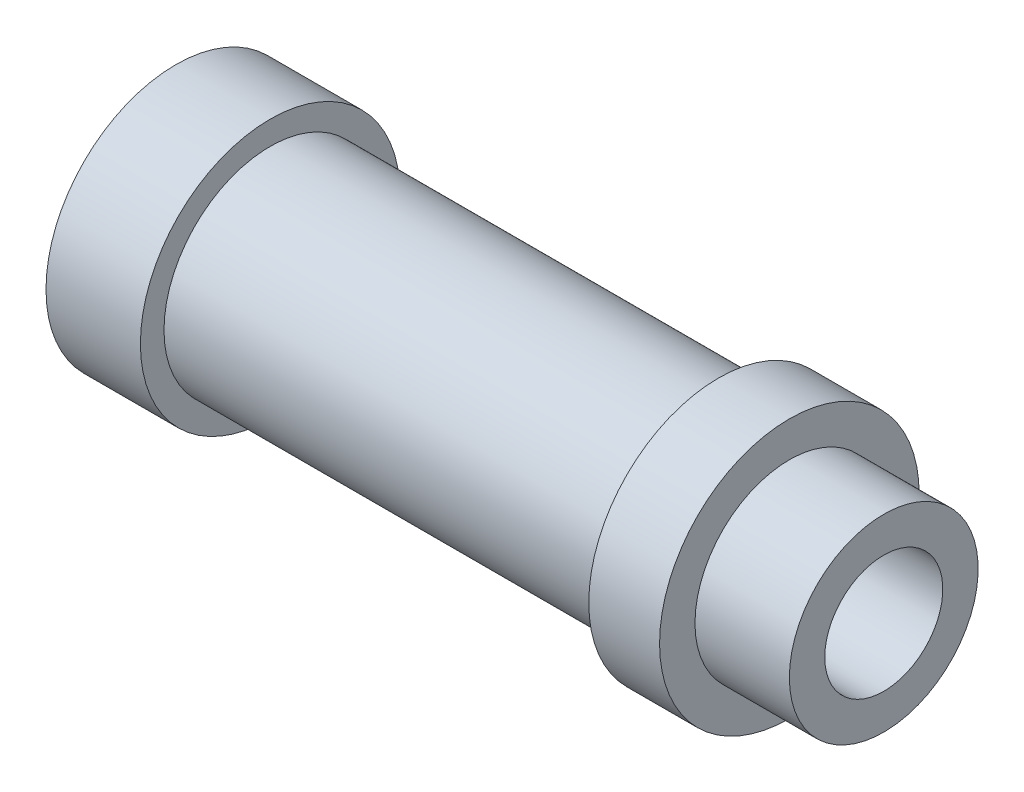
ISO-10303-21;
HEADER;
FILE_DESCRIPTION(('STEP AP214'),'2;1');
FILE_NAME('part.step','',(''),(''),'','','');
FILE_SCHEMA(('AUTOMOTIVE_DESIGN { 1 0 10303 214 1 1 1 1 }'));
ENDSEC;
DATA;
#1=APPLICATION_CONTEXT('core data for automotive mechanical design processes');
#2=APPLICATION_PROTOCOL_DEFINITION('international standard','automotive_design',2000,#1);
#3=PRODUCT_CONTEXT('',#1,'mechanical');
#4=PRODUCT('Part','Part','',(#3));
#5=PRODUCT_RELATED_PRODUCT_CATEGORY('part','',(#4));
#6=PRODUCT_DEFINITION_FORMATION('','',#4);
#7=PRODUCT_DEFINITION_CONTEXT('part definition',#1,'design');
#8=PRODUCT_DEFINITION('design','',#6,#7);
#9=PRODUCT_DEFINITION_SHAPE('','',#8);
#10=(LENGTH_UNIT() NAMED_UNIT(*) SI_UNIT(.MILLI.,.METRE.));
#11=(NAMED_UNIT(*) PLANE_ANGLE_UNIT() SI_UNIT($,.RADIAN.));
#12=(NAMED_UNIT(*) SI_UNIT($,.STERADIAN.) SOLID_ANGLE_UNIT());
#13=UNCERTAINTY_MEASURE_WITH_UNIT(LENGTH_MEASURE(1.E-05),#10,'distance_accuracy_value','');
#14=(GEOMETRIC_REPRESENTATION_CONTEXT(3) GLOBAL_UNCERTAINTY_ASSIGNED_CONTEXT((#13)) GLOBAL_UNIT_ASSIGNED_CONTEXT((#10,
#11,#12)) REPRESENTATION_CONTEXT('',''));
#15=CARTESIAN_POINT('',(0.,0.,0.));
#16=DIRECTION('',(0.,0.,1.));
#17=DIRECTION('',(1.,0.,0.));
#18=AXIS2_PLACEMENT_3D('',#15,#16,#17);
#19=CARTESIAN_POINT('',(-6.05996098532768,0.,0.));
#20=DIRECTION('',(-1.,0.,0.));
#21=DIRECTION('',(0.,0.,1.));
#22=AXIS2_PLACEMENT_3D('',#19,#20,#21);
#23=CYLINDRICAL_SURFACE('',#22,2.75);
#24=CARTESIAN_POINT('',(0.,0.,0.));
#25=DIRECTION('',(-1.,0.,0.));
#26=DIRECTION('',(0.,0.,1.));
#27=AXIS2_PLACEMENT_3D('',#24,#25,#26);
#28=CIRCLE('',#27,2.75);
#29=CARTESIAN_POINT('',(0.,0.,2.75));
#30=VERTEX_POINT('',#29);
#31=EDGE_CURVE('E10',#30,#30,#28,.T.);
#32=ORIENTED_EDGE('',*,*,#31,.F.);
#33=EDGE_LOOP('',(#32));
#34=FACE_BOUND('',#33,.T.);
#35=CARTESIAN_POINT('',(2.,0.,0.));
#36=DIRECTION('',(-1.,0.,0.));
#37=DIRECTION('',(0.,0.,1.));
#38=AXIS2_PLACEMENT_3D('',#35,#36,#37);
#39=CIRCLE('',#38,2.75);
#40=CARTESIAN_POINT('',(2.,0.,2.75));
#41=VERTEX_POINT('',#40);
#42=EDGE_CURVE('E68',#41,#41,#39,.T.);
#43=ORIENTED_EDGE('',*,*,#42,.T.);
#44=EDGE_LOOP('',(#43));
#45=FACE_BOUND('',#44,.T.);
#46=ADVANCED_FACE('F31',(#34,#45),#23,.T.);
#47=CARTESIAN_POINT('',(0.,2.75,0.));
#48=DIRECTION('',(1.,0.,0.));
#49=DIRECTION('',(0.,0.,-1.));
#50=AXIS2_PLACEMENT_3D('',#47,#48,#49);
#51=PLANE('',#50);
#52=CARTESIAN_POINT('',(0.,0.,0.));
#53=DIRECTION('',(-1.,0.,0.));
#54=DIRECTION('',(0.,0.,1.));
#55=AXIS2_PLACEMENT_3D('',#52,#53,#54);
#56=CIRCLE('',#55,2.);
#57=CARTESIAN_POINT('',(0.,0.,2.));
#58=VERTEX_POINT('',#57);
#59=EDGE_CURVE('E37',#58,#58,#56,.T.);
#60=ORIENTED_EDGE('',*,*,#59,.F.);
#61=EDGE_LOOP('',(#60));
#62=FACE_BOUND('',#61,.T.);
#63=ORIENTED_EDGE('',*,*,#31,.T.);
#64=EDGE_LOOP('',(#63));
#65=FACE_BOUND('',#64,.T.);
#66=ADVANCED_FACE('F123',(#62,#65),#51,.F.);
#67=CARTESIAN_POINT('',(0.,0.,0.));
#68=DIRECTION('',(-1.,0.,0.));
#69=DIRECTION('',(0.,0.,1.));
#70=AXIS2_PLACEMENT_3D('',#67,#68,#69);
#71=CONICAL_SURFACE('',#70,2.,0.31415926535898);
#72=CARTESIAN_POINT('',(2.30826265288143,0.,0.));
#73=DIRECTION('',(-1.,0.,0.));
#74=DIRECTION('',(0.,0.,1.));
#75=AXIS2_PLACEMENT_3D('',#72,#73,#74);
#76=CIRCLE('',#75,1.25);
#77=CARTESIAN_POINT('',(2.30826265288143,0.,1.25));
#78=VERTEX_POINT('',#77);
#79=EDGE_CURVE('E41',#78,#78,#76,.T.);
#80=ORIENTED_EDGE('',*,*,#79,.F.);
#81=EDGE_LOOP('',(#80));
#82=FACE_BOUND('',#81,.T.);
#83=ORIENTED_EDGE('',*,*,#59,.T.);
#84=EDGE_LOOP('',(#83));
#85=FACE_BOUND('',#84,.T.);
#86=ADVANCED_FACE('F118',(#82,#85),#71,.F.);
#87=CARTESIAN_POINT('',(-6.05996098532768,0.,0.));
#88=DIRECTION('',(-1.,0.,0.));
#89=DIRECTION('',(0.,0.,1.));
#90=AXIS2_PLACEMENT_3D('',#87,#88,#89);
#91=CYLINDRICAL_SURFACE('',#90,1.25);
#92=CARTESIAN_POINT('',(15.,0.,0.));
#93=DIRECTION('',(-1.,0.,0.));
#94=DIRECTION('',(0.,0.,1.));
#95=AXIS2_PLACEMENT_3D('',#92,#93,#94);
#96=CIRCLE('',#95,1.25);
#97=CARTESIAN_POINT('',(15.,0.,1.25));
#98=VERTEX_POINT('',#97);
#99=EDGE_CURVE('E45',#98,#98,#96,.T.);
#100=ORIENTED_EDGE('',*,*,#99,.F.);
#101=EDGE_LOOP('',(#100));
#102=FACE_BOUND('',#101,.T.);
#103=ORIENTED_EDGE('',*,*,#79,.T.);
#104=EDGE_LOOP('',(#103));
#105=FACE_BOUND('',#104,.T.);
#106=ADVANCED_FACE('F112',(#102,#105),#91,.F.);
#107=CARTESIAN_POINT('',(15.,2.,0.));
#108=DIRECTION('',(-1.,0.,0.));
#109=DIRECTION('',(0.,0.,1.));
#110=AXIS2_PLACEMENT_3D('',#107,#108,#109);
#111=PLANE('',#110);
#112=CARTESIAN_POINT('',(15.,0.,0.));
#113=DIRECTION('',(-1.,0.,0.));
#114=DIRECTION('',(0.,0.,1.));
#115=AXIS2_PLACEMENT_3D('',#112,#113,#114);
#116=CIRCLE('',#115,2.);
#117=CARTESIAN_POINT('',(15.,0.,2.));
#118=VERTEX_POINT('',#117);
#119=EDGE_CURVE('E50',#118,#118,#116,.T.);
#120=ORIENTED_EDGE('',*,*,#119,.F.);
#121=EDGE_LOOP('',(#120));
#122=FACE_BOUND('',#121,.T.);
#123=ORIENTED_EDGE('',*,*,#99,.T.);
#124=EDGE_LOOP('',(#123));
#125=FACE_BOUND('',#124,.T.);
#126=ADVANCED_FACE('F106',(#122,#125),#111,.F.);
#127=CARTESIAN_POINT('',(-6.05996098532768,0.,0.));
#128=DIRECTION('',(-1.,0.,0.));
#129=DIRECTION('',(0.,0.,1.));
#130=AXIS2_PLACEMENT_3D('',#127,#128,#129);
#131=CYLINDRICAL_SURFACE('',#130,2.);
#132=CARTESIAN_POINT('',(13.,0.,0.));
#133=DIRECTION('',(-1.,0.,0.));
#134=DIRECTION('',(0.,0.,1.));
#135=AXIS2_PLACEMENT_3D('',#132,#133,#134);
#136=CIRCLE('',#135,2.);
#137=CARTESIAN_POINT('',(13.,0.,2.));
#138=VERTEX_POINT('',#137);
#139=EDGE_CURVE('E53',#138,#138,#136,.T.);
#140=ORIENTED_EDGE('',*,*,#139,.F.);
#141=EDGE_LOOP('',(#140));
#142=FACE_BOUND('',#141,.T.);
#143=ORIENTED_EDGE('',*,*,#119,.T.);
#144=EDGE_LOOP('',(#143));
#145=FACE_BOUND('',#144,.T.);
#146=ADVANCED_FACE('F100',(#142,#145),#131,.T.);
#147=CARTESIAN_POINT('',(13.,2.75,0.));
#148=DIRECTION('',(-1.,0.,0.));
#149=DIRECTION('',(0.,0.,1.));
#150=AXIS2_PLACEMENT_3D('',#147,#148,#149);
#151=PLANE('',#150);
#152=CARTESIAN_POINT('',(13.,0.,0.));
#153=DIRECTION('',(-1.,0.,0.));
#154=DIRECTION('',(0.,0.,1.));
#155=AXIS2_PLACEMENT_3D('',#152,#153,#154);
#156=CIRCLE('',#155,2.75);
#157=CARTESIAN_POINT('',(13.,0.,2.75));
#158=VERTEX_POINT('',#157);
#159=EDGE_CURVE('E56',#158,#158,#156,.T.);
#160=ORIENTED_EDGE('',*,*,#159,.F.);
#161=EDGE_LOOP('',(#160));
#162=FACE_BOUND('',#161,.T.);
#163=ORIENTED_EDGE('',*,*,#139,.T.);
#164=EDGE_LOOP('',(#163));
#165=FACE_BOUND('',#164,.T.);
#166=ADVANCED_FACE('F94',(#162,#165),#151,.F.);
#167=CARTESIAN_POINT('',(-6.05996098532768,0.,0.));
#168=DIRECTION('',(-1.,0.,0.));
#169=DIRECTION('',(0.,0.,1.));
#170=AXIS2_PLACEMENT_3D('',#167,#168,#169);
#171=CYLINDRICAL_SURFACE('',#170,2.75);
#172=CARTESIAN_POINT('',(11.5,0.,0.));
#173=DIRECTION('',(-1.,0.,0.));
#174=DIRECTION('',(0.,0.,1.));
#175=AXIS2_PLACEMENT_3D('',#172,#173,#174);
#176=CIRCLE('',#175,2.75);
#177=CARTESIAN_POINT('',(11.5,0.,2.75));
#178=VERTEX_POINT('',#177);
#179=EDGE_CURVE('E59',#178,#178,#176,.T.);
#180=ORIENTED_EDGE('',*,*,#179,.F.);
#181=EDGE_LOOP('',(#180));
#182=FACE_BOUND('',#181,.T.);
#183=ORIENTED_EDGE('',*,*,#159,.T.);
#184=EDGE_LOOP('',(#183));
#185=FACE_BOUND('',#184,.T.);
#186=ADVANCED_FACE('F88',(#182,#185),#171,.T.);
#187=CARTESIAN_POINT('',(11.5,2.75,0.));
#188=DIRECTION('',(1.,0.,0.));
#189=DIRECTION('',(0.,0.,-1.));
#190=AXIS2_PLACEMENT_3D('',#187,#188,#189);
#191=PLANE('',#190);
#192=CARTESIAN_POINT('',(11.5,0.,0.));
#193=DIRECTION('',(-1.,0.,0.));
#194=DIRECTION('',(0.,0.,1.));
#195=AXIS2_PLACEMENT_3D('',#192,#193,#194);
#196=CIRCLE('',#195,2.25);
#197=CARTESIAN_POINT('',(11.5,0.,2.25));
#198=VERTEX_POINT('',#197);
#199=EDGE_CURVE('E62',#198,#198,#196,.T.);
#200=ORIENTED_EDGE('',*,*,#199,.F.);
#201=EDGE_LOOP('',(#200));
#202=FACE_BOUND('',#201,.T.);
#203=ORIENTED_EDGE('',*,*,#179,.T.);
#204=EDGE_LOOP('',(#203));
#205=FACE_BOUND('',#204,.T.);
#206=ADVANCED_FACE('F82',(#202,#205),#191,.F.);
#207=CARTESIAN_POINT('',(-6.05996098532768,0.,0.));
#208=DIRECTION('',(-1.,0.,0.));
#209=DIRECTION('',(0.,0.,1.));
#210=AXIS2_PLACEMENT_3D('',#207,#208,#209);
#211=CYLINDRICAL_SURFACE('',#210,2.25);
#212=CARTESIAN_POINT('',(2.,0.,0.));
#213=DIRECTION('',(-1.,0.,0.));
#214=DIRECTION('',(0.,0.,1.));
#215=AXIS2_PLACEMENT_3D('',#212,#213,#214);
#216=CIRCLE('',#215,2.25);
#217=CARTESIAN_POINT('',(2.,0.,2.25));
#218=VERTEX_POINT('',#217);
#219=EDGE_CURVE('E65',#218,#218,#216,.T.);
#220=ORIENTED_EDGE('',*,*,#219,.F.);
#221=EDGE_LOOP('',(#220));
#222=FACE_BOUND('',#221,.T.);
#223=ORIENTED_EDGE('',*,*,#199,.T.);
#224=EDGE_LOOP('',(#223));
#225=FACE_BOUND('',#224,.T.);
#226=ADVANCED_FACE('F76',(#222,#225),#211,.T.);
#227=CARTESIAN_POINT('',(2.,2.25,0.));
#228=DIRECTION('',(-1.,0.,0.));
#229=DIRECTION('',(0.,0.,1.));
#230=AXIS2_PLACEMENT_3D('',#227,#228,#229);
#231=PLANE('',#230);
#232=ORIENTED_EDGE('',*,*,#42,.F.);
#233=EDGE_LOOP('',(#232));
#234=FACE_BOUND('',#233,.T.);
#235=ORIENTED_EDGE('',*,*,#219,.T.);
#236=EDGE_LOOP('',(#235));
#237=FACE_BOUND('',#236,.T.);
#238=ADVANCED_FACE('F73',(#234,#237),#231,.F.);
#239=CLOSED_SHELL('',(#46,#66,#86,#106,#126,#146,#166,#186,#206,#226,#238));
#240=MANIFOLD_SOLID_BREP('B2',#239);
#241=ADVANCED_BREP_SHAPE_REPRESENTATION('',(#18,#240),#14);
#242=SHAPE_DEFINITION_REPRESENTATION(#9,#241);
ENDSEC;
END-ISO-10303-21;
